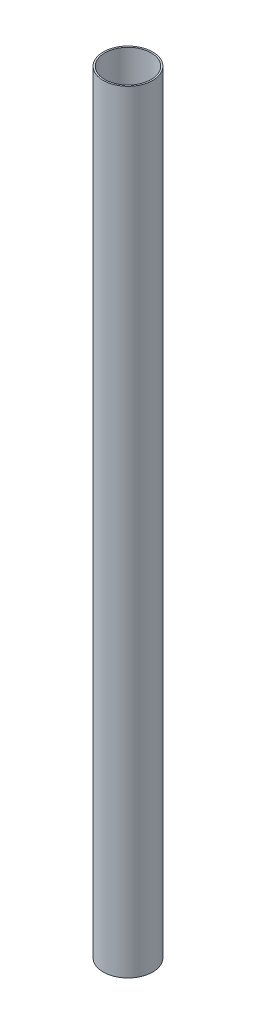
ISO-10303-21;
HEADER;
FILE_DESCRIPTION(('STEP AP214'),'2;1');
FILE_NAME('part.step','',(''),(''),'','','');
FILE_SCHEMA(('AUTOMOTIVE_DESIGN { 1 0 10303 214 1 1 1 1 }'));
ENDSEC;
DATA;
#1=APPLICATION_CONTEXT('core data for automotive mechanical design processes');
#2=APPLICATION_PROTOCOL_DEFINITION('international standard','automotive_design',2000,#1);
#3=PRODUCT_CONTEXT('',#1,'mechanical');
#4=PRODUCT('Part','Part','',(#3));
#5=PRODUCT_RELATED_PRODUCT_CATEGORY('part','',(#4));
#6=PRODUCT_DEFINITION_FORMATION('','',#4);
#7=PRODUCT_DEFINITION_CONTEXT('part definition',#1,'design');
#8=PRODUCT_DEFINITION('design','',#6,#7);
#9=PRODUCT_DEFINITION_SHAPE('','',#8);
#10=(LENGTH_UNIT() NAMED_UNIT(*) SI_UNIT(.MILLI.,.METRE.));
#11=(NAMED_UNIT(*) PLANE_ANGLE_UNIT() SI_UNIT($,.RADIAN.));
#12=(NAMED_UNIT(*) SI_UNIT($,.STERADIAN.) SOLID_ANGLE_UNIT());
#13=UNCERTAINTY_MEASURE_WITH_UNIT(LENGTH_MEASURE(1.E-05),#10,'distance_accuracy_value','');
#14=(GEOMETRIC_REPRESENTATION_CONTEXT(3) GLOBAL_UNCERTAINTY_ASSIGNED_CONTEXT((#13)) GLOBAL_UNIT_ASSIGNED_CONTEXT((#10,
#11,#12)) REPRESENTATION_CONTEXT('',''));
#15=CARTESIAN_POINT('',(0.,0.,0.));
#16=DIRECTION('',(0.,0.,1.));
#17=DIRECTION('',(1.,0.,0.));
#18=AXIS2_PLACEMENT_3D('',#15,#16,#17);
#19=CARTESIAN_POINT('',(0.,250.,0.));
#20=DIRECTION('',(0.,1.,0.));
#21=DIRECTION('',(0.,0.,1.));
#22=AXIS2_PLACEMENT_3D('',#19,#20,#21);
#23=PLANE('',#22);
#24=CARTESIAN_POINT('',(0.,250.,0.));
#25=DIRECTION('',(0.,1.,0.));
#26=DIRECTION('',(0.,0.,1.));
#27=AXIS2_PLACEMENT_3D('',#24,#25,#26);
#28=CIRCLE('',#27,8.);
#29=CARTESIAN_POINT('',(0.,250.,8.));
#30=VERTEX_POINT('',#29);
#31=EDGE_CURVE('E10',#30,#30,#28,.T.);
#32=ORIENTED_EDGE('',*,*,#31,.T.);
#33=EDGE_LOOP('',(#32));
#34=FACE_BOUND('',#33,.T.);
#35=CARTESIAN_POINT('',(0.,250.,0.));
#36=DIRECTION('',(0.,1.,0.));
#37=DIRECTION('',(0.,0.,1.));
#38=AXIS2_PLACEMENT_3D('',#35,#36,#37);
#39=CIRCLE('',#38,7.5);
#40=CARTESIAN_POINT('',(0.,250.,7.5));
#41=VERTEX_POINT('',#40);
#42=EDGE_CURVE('E42',#41,#41,#39,.T.);
#43=ORIENTED_EDGE('',*,*,#42,.F.);
#44=EDGE_LOOP('',(#43));
#45=FACE_BOUND('',#44,.T.);
#46=ADVANCED_FACE('F31',(#34,#45),#23,.T.);
#47=CARTESIAN_POINT('',(0.,0.,0.));
#48=DIRECTION('',(0.,1.,0.));
#49=DIRECTION('',(0.,0.,1.));
#50=AXIS2_PLACEMENT_3D('',#47,#48,#49);
#51=PLANE('',#50);
#52=CARTESIAN_POINT('',(0.,0.,0.));
#53=DIRECTION('',(0.,1.,0.));
#54=DIRECTION('',(0.,0.,1.));
#55=AXIS2_PLACEMENT_3D('',#52,#53,#54);
#56=CIRCLE('',#55,8.);
#57=CARTESIAN_POINT('',(0.,0.,8.));
#58=VERTEX_POINT('',#57);
#59=EDGE_CURVE('E35',#58,#58,#56,.T.);
#60=ORIENTED_EDGE('',*,*,#59,.F.);
#61=EDGE_LOOP('',(#60));
#62=FACE_BOUND('',#61,.T.);
#63=CARTESIAN_POINT('',(0.,0.,0.));
#64=DIRECTION('',(0.,1.,0.));
#65=DIRECTION('',(0.,0.,1.));
#66=AXIS2_PLACEMENT_3D('',#63,#64,#65);
#67=CIRCLE('',#66,7.5);
#68=CARTESIAN_POINT('',(0.,0.,7.5));
#69=VERTEX_POINT('',#68);
#70=EDGE_CURVE('E44',#69,#69,#67,.T.);
#71=ORIENTED_EDGE('',*,*,#70,.T.);
#72=EDGE_LOOP('',(#71));
#73=FACE_BOUND('',#72,.T.);
#74=ADVANCED_FACE('F54',(#62,#73),#51,.F.);
#75=CARTESIAN_POINT('',(0.,250.,0.));
#76=DIRECTION('',(0.,-1.,0.));
#77=DIRECTION('',(0.,0.,-1.));
#78=AXIS2_PLACEMENT_3D('',#75,#76,#77);
#79=CYLINDRICAL_SURFACE('',#78,8.);
#80=ORIENTED_EDGE('',*,*,#31,.F.);
#81=EDGE_LOOP('',(#80));
#82=FACE_BOUND('',#81,.T.);
#83=ORIENTED_EDGE('',*,*,#59,.T.);
#84=EDGE_LOOP('',(#83));
#85=FACE_BOUND('',#84,.T.);
#86=ADVANCED_FACE('F33',(#82,#85),#79,.T.);
#87=CARTESIAN_POINT('',(0.,250.,0.));
#88=DIRECTION('',(0.,-1.,0.));
#89=DIRECTION('',(0.,0.,-1.));
#90=AXIS2_PLACEMENT_3D('',#87,#88,#89);
#91=CYLINDRICAL_SURFACE('',#90,7.5);
#92=ORIENTED_EDGE('',*,*,#42,.T.);
#93=EDGE_LOOP('',(#92));
#94=FACE_BOUND('',#93,.T.);
#95=ORIENTED_EDGE('',*,*,#70,.F.);
#96=EDGE_LOOP('',(#95));
#97=FACE_BOUND('',#96,.T.);
#98=ADVANCED_FACE('F50',(#94,#97),#91,.F.);
#99=CLOSED_SHELL('',(#46,#74,#86,#98));
#100=MANIFOLD_SOLID_BREP('B2',#99);
#101=ADVANCED_BREP_SHAPE_REPRESENTATION('',(#18,#100),#14);
#102=SHAPE_DEFINITION_REPRESENTATION(#9,#101);
ENDSEC;
END-ISO-10303-21;
